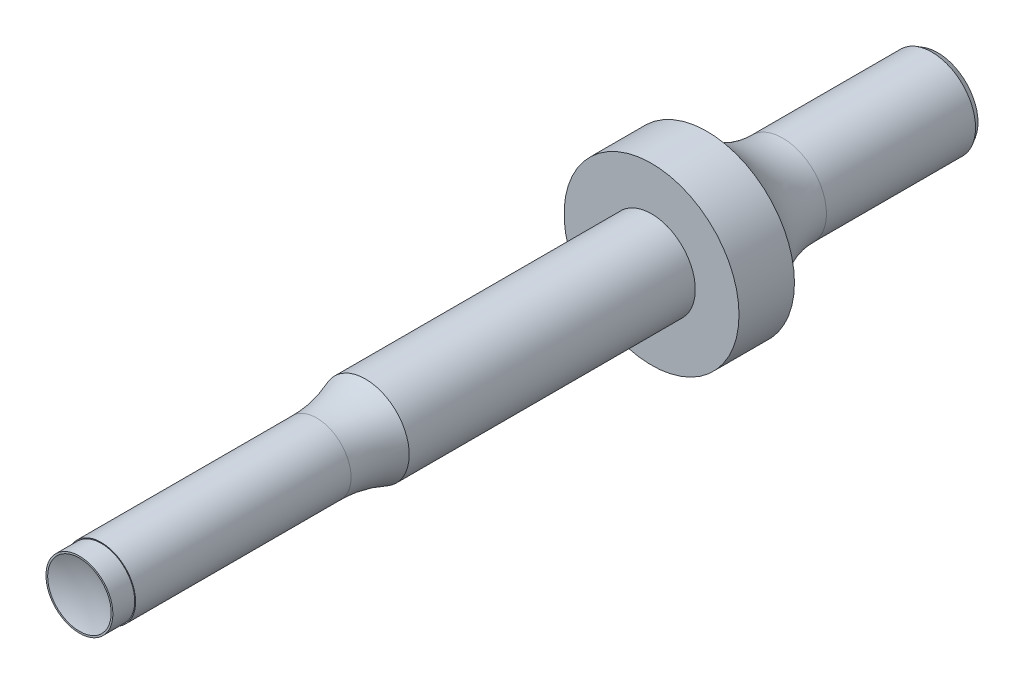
ISO-10303-21;
HEADER;
FILE_DESCRIPTION(('STEP AP214'),'2;1');
FILE_NAME('part.step','',(''),(''),'','','');
FILE_SCHEMA(('AUTOMOTIVE_DESIGN { 1 0 10303 214 1 1 1 1 }'));
ENDSEC;
DATA;
#1=APPLICATION_CONTEXT('core data for automotive mechanical design processes');
#2=APPLICATION_PROTOCOL_DEFINITION('international standard','automotive_design',2000,#1);
#3=PRODUCT_CONTEXT('',#1,'mechanical');
#4=PRODUCT('Part','Part','',(#3));
#5=PRODUCT_RELATED_PRODUCT_CATEGORY('part','',(#4));
#6=PRODUCT_DEFINITION_FORMATION('','',#4);
#7=PRODUCT_DEFINITION_CONTEXT('part definition',#1,'design');
#8=PRODUCT_DEFINITION('design','',#6,#7);
#9=PRODUCT_DEFINITION_SHAPE('','',#8);
#10=(LENGTH_UNIT() NAMED_UNIT(*) SI_UNIT(.MILLI.,.METRE.));
#11=(NAMED_UNIT(*) PLANE_ANGLE_UNIT() SI_UNIT($,.RADIAN.));
#12=(NAMED_UNIT(*) SI_UNIT($,.STERADIAN.) SOLID_ANGLE_UNIT());
#13=UNCERTAINTY_MEASURE_WITH_UNIT(LENGTH_MEASURE(1.E-05),#10,'distance_accuracy_value','');
#14=(GEOMETRIC_REPRESENTATION_CONTEXT(3) GLOBAL_UNCERTAINTY_ASSIGNED_CONTEXT((#13)) GLOBAL_UNIT_ASSIGNED_CONTEXT((#10,
#11,#12)) REPRESENTATION_CONTEXT('',''));
#15=CARTESIAN_POINT('',(0.,0.,0.));
#16=DIRECTION('',(0.,0.,1.));
#17=DIRECTION('',(1.,0.,0.));
#18=AXIS2_PLACEMENT_3D('',#15,#16,#17);
#19=CARTESIAN_POINT('',(0.,0.,-100.));
#20=DIRECTION('',(0.,0.,1.));
#21=DIRECTION('',(1.,0.,0.));
#22=AXIS2_PLACEMENT_3D('',#19,#20,#21);
#23=CYLINDRICAL_SURFACE('',#22,5.095);
#24=CARTESIAN_POINT('',(0.,0.,-33.3333333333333));
#25=DIRECTION('',(0.,0.,-1.));
#26=DIRECTION('',(0.,1.,0.));
#27=AXIS2_PLACEMENT_3D('',#24,#25,#26);
#28=CIRCLE('',#27,5.095);
#29=CARTESIAN_POINT('',(0.,5.095,-33.3333333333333));
#30=VERTEX_POINT('',#29);
#31=EDGE_CURVE('E78',#30,#30,#28,.T.);
#32=ORIENTED_EDGE('',*,*,#31,.T.);
#33=EDGE_LOOP('',(#32));
#34=FACE_BOUND('',#33,.T.);
#35=CARTESIAN_POINT('',(0.,0.,-66.6666666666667));
#36=DIRECTION('',(0.,0.,-1.));
#37=DIRECTION('',(-1.,0.,0.));
#38=AXIS2_PLACEMENT_3D('',#35,#36,#37);
#39=CIRCLE('',#38,5.095);
#40=CARTESIAN_POINT('',(-5.095,0.,-66.6666666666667));
#41=VERTEX_POINT('',#40);
#42=EDGE_CURVE('E44',#41,#41,#39,.F.);
#43=ORIENTED_EDGE('',*,*,#42,.T.);
#44=EDGE_LOOP('',(#43));
#45=FACE_BOUND('',#44,.T.);
#46=ADVANCED_FACE('F40',(#34,#45),#23,.T.);
#47=CARTESIAN_POINT('',(0.,0.,-33.3333333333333));
#48=DIRECTION('',(0.,0.,1.));
#49=DIRECTION('',(1.,0.,0.));
#50=AXIS2_PLACEMENT_3D('',#47,#48,#49);
#51=CYLINDRICAL_SURFACE('',#50,4.);
#52=CARTESIAN_POINT('',(0.,0.,-27.6522132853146));
#53=DIRECTION('',(0.,0.,1.));
#54=DIRECTION('',(0.,-1.,0.));
#55=AXIS2_PLACEMENT_3D('',#52,#53,#54);
#56=CIRCLE('',#55,4.);
#57=CARTESIAN_POINT('',(0.,-4.,-27.6522132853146));
#58=VERTEX_POINT('',#57);
#59=EDGE_CURVE('E12',#58,#58,#56,.F.);
#60=ORIENTED_EDGE('',*,*,#59,.F.);
#61=EDGE_LOOP('',(#60));
#62=FACE_BOUND('',#61,.T.);
#63=CARTESIAN_POINT('',(0.,0.,-2.5475));
#64=DIRECTION('',(0.,0.,1.));
#65=DIRECTION('',(1.,0.,0.));
#66=AXIS2_PLACEMENT_3D('',#63,#64,#65);
#67=CIRCLE('',#66,4.);
#68=CARTESIAN_POINT('',(4.,0.,-2.5475));
#69=VERTEX_POINT('',#68);
#70=EDGE_CURVE('E62',#69,#69,#67,.F.);
#71=ORIENTED_EDGE('',*,*,#70,.T.);
#72=EDGE_LOOP('',(#71));
#73=FACE_BOUND('',#72,.T.);
#74=ADVANCED_FACE('F105',(#62,#73),#51,.T.);
#75=CARTESIAN_POINT('',(0.,0.,-2.5475));
#76=DIRECTION('',(0.,0.,1.));
#77=DIRECTION('',(1.,0.,0.));
#78=AXIS2_PLACEMENT_3D('',#75,#76,#77);
#79=PLANE('',#78);
#80=ORIENTED_EDGE('',*,*,#70,.F.);
#81=EDGE_LOOP('',(#80));
#82=FACE_BOUND('',#81,.T.);
#83=CARTESIAN_POINT('',(0.,0.,-2.5475));
#84=DIRECTION('',(0.,0.,1.));
#85=DIRECTION('',(1.,0.,0.));
#86=AXIS2_PLACEMENT_3D('',#83,#84,#85);
#87=CIRCLE('',#86,3.9);
#88=CARTESIAN_POINT('',(3.9,0.,-2.5475));
#89=VERTEX_POINT('',#88);
#90=EDGE_CURVE('E66',#89,#89,#87,.T.);
#91=ORIENTED_EDGE('',*,*,#90,.F.);
#92=EDGE_LOOP('',(#91));
#93=FACE_BOUND('',#92,.T.);
#94=ADVANCED_FACE('F110',(#82,#93),#79,.T.);
#95=CARTESIAN_POINT('',(0.,0.,-2.5475));
#96=DIRECTION('',(0.,0.,1.));
#97=DIRECTION('',(1.,0.,0.));
#98=AXIS2_PLACEMENT_3D('',#95,#96,#97);
#99=CYLINDRICAL_SURFACE('',#98,3.9);
#100=CARTESIAN_POINT('',(0.,0.,0.));
#101=DIRECTION('',(0.,0.,1.));
#102=DIRECTION('',(1.,0.,0.));
#103=AXIS2_PLACEMENT_3D('',#100,#101,#102);
#104=CIRCLE('',#103,3.9);
#105=CARTESIAN_POINT('',(3.9,0.,0.));
#106=VERTEX_POINT('',#105);
#107=EDGE_CURVE('E67',#106,#106,#104,.T.);
#108=CARTESIAN_POINT('',(3.9,0.,-2.5475));
#109=CARTESIAN_POINT('',(3.9,0.,-2.52096354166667));
#110=CARTESIAN_POINT('',(3.9,0.,-2.49442708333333));
#111=CARTESIAN_POINT('',(3.9,0.,-2.44135416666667));
#112=CARTESIAN_POINT('',(3.9,0.,-2.41481770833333));
#113=CARTESIAN_POINT('',(3.9,0.,-2.36174479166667));
#114=CARTESIAN_POINT('',(3.9,0.,-2.33520833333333));
#115=CARTESIAN_POINT('',(3.9,0.,-2.28213541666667));
#116=CARTESIAN_POINT('',(3.9,0.,-2.25559895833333));
#117=CARTESIAN_POINT('',(3.9,0.,-2.20252604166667));
#118=CARTESIAN_POINT('',(3.9,0.,-2.17598958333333));
#119=CARTESIAN_POINT('',(3.9,0.,-2.12291666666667));
#120=CARTESIAN_POINT('',(3.9,0.,-2.09638020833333));
#121=CARTESIAN_POINT('',(3.9,0.,-2.04330729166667));
#122=CARTESIAN_POINT('',(3.9,0.,-2.01677083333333));
#123=CARTESIAN_POINT('',(3.9,0.,-1.96369791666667));
#124=CARTESIAN_POINT('',(3.9,0.,-1.93716145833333));
#125=CARTESIAN_POINT('',(3.9,0.,-1.88408854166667));
#126=CARTESIAN_POINT('',(3.9,0.,-1.85755208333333));
#127=CARTESIAN_POINT('',(3.9,0.,-1.80447916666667));
#128=CARTESIAN_POINT('',(3.9,0.,-1.77794270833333));
#129=CARTESIAN_POINT('',(3.9,0.,-1.72486979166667));
#130=CARTESIAN_POINT('',(3.9,0.,-1.69833333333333));
#131=CARTESIAN_POINT('',(3.9,0.,-1.64526041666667));
#132=CARTESIAN_POINT('',(3.9,0.,-1.61872395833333));
#133=CARTESIAN_POINT('',(3.9,0.,-1.56565104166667));
#134=CARTESIAN_POINT('',(3.9,0.,-1.53911458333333));
#135=CARTESIAN_POINT('',(3.9,0.,-1.48604166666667));
#136=CARTESIAN_POINT('',(3.9,0.,-1.45950520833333));
#137=CARTESIAN_POINT('',(3.9,0.,-1.40643229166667));
#138=CARTESIAN_POINT('',(3.9,0.,-1.37989583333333));
#139=CARTESIAN_POINT('',(3.9,0.,-1.32682291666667));
#140=CARTESIAN_POINT('',(3.9,0.,-1.30028645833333));
#141=CARTESIAN_POINT('',(3.9,0.,-1.24721354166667));
#142=CARTESIAN_POINT('',(3.9,0.,-1.22067708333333));
#143=CARTESIAN_POINT('',(3.9,0.,-1.16760416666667));
#144=CARTESIAN_POINT('',(3.9,0.,-1.14106770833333));
#145=CARTESIAN_POINT('',(3.9,0.,-1.08799479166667));
#146=CARTESIAN_POINT('',(3.9,0.,-1.06145833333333));
#147=CARTESIAN_POINT('',(3.9,0.,-1.00838541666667));
#148=CARTESIAN_POINT('',(3.9,0.,-0.981848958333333));
#149=CARTESIAN_POINT('',(3.9,0.,-0.928776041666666));
#150=CARTESIAN_POINT('',(3.9,0.,-0.902239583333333));
#151=CARTESIAN_POINT('',(3.9,0.,-0.849166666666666));
#152=CARTESIAN_POINT('',(3.9,0.,-0.822630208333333));
#153=CARTESIAN_POINT('',(3.9,0.,-0.769557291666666));
#154=CARTESIAN_POINT('',(3.9,0.,-0.743020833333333));
#155=CARTESIAN_POINT('',(3.9,0.,-0.689947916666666));
#156=CARTESIAN_POINT('',(3.9,0.,-0.663411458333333));
#157=CARTESIAN_POINT('',(3.9,0.,-0.610338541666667));
#158=CARTESIAN_POINT('',(3.9,0.,-0.583802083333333));
#159=CARTESIAN_POINT('',(3.9,0.,-0.530729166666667));
#160=CARTESIAN_POINT('',(3.9,0.,-0.504192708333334));
#161=CARTESIAN_POINT('',(3.9,0.,-0.451119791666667));
#162=CARTESIAN_POINT('',(3.9,0.,-0.424583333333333));
#163=CARTESIAN_POINT('',(3.9,0.,-0.371510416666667));
#164=CARTESIAN_POINT('',(3.9,0.,-0.344973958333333));
#165=CARTESIAN_POINT('',(3.9,0.,-0.291901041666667));
#166=CARTESIAN_POINT('',(3.9,0.,-0.265364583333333));
#167=CARTESIAN_POINT('',(3.9,0.,-0.212291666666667));
#168=CARTESIAN_POINT('',(3.9,0.,-0.185755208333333));
#169=CARTESIAN_POINT('',(3.9,0.,-0.132682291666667));
#170=CARTESIAN_POINT('',(3.9,0.,-0.106145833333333));
#171=CARTESIAN_POINT('',(3.9,0.,-0.0530729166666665));
#172=CARTESIAN_POINT('',(3.9,0.,-0.0265364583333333));
#173=CARTESIAN_POINT('',(3.9,0.,0.));
#174=B_SPLINE_CURVE_WITH_KNOTS('',3,(#108,#109,#110,#111,#112,#113,#114,#115,#116,#117,#118,
#119,#120,#121,#122,#123,#124,#125,#126,#127,#128,#129,#130,#131,#132,#133,#134,#135,#136,#137,
#138,#139,#140,#141,#142,#143,#144,#145,#146,#147,#148,#149,#150,#151,#152,#153,#154,#155,#156,
#157,#158,#159,#160,#161,#162,#163,#164,#165,#166,#167,#168,#169,#170,#171,#172,#173),
.UNSPECIFIED.,.F.,.F.,(4,2,2,2,2,2,2,2,2,2,2,2,2,2,2,2,2,2,2,2,2,2,2,2,2,2,2,2,2,2,2,2,4),(0.,
0.0796093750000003,0.15921875,0.238828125,0.3184375,0.398046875,0.47765625,0.557265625,0.636875,
0.716484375,0.79609375,0.875703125,0.9553125,1.034921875,1.11453125,1.194140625,1.27375,
1.353359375,1.43296875,1.512578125,1.5921875,1.671796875,1.75140625,1.831015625,1.910625,
1.990234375,2.06984375,2.149453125,2.2290625,2.308671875,2.38828125,2.467890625,2.5475),.UNSPECIFIED.);
#175=EDGE_CURVE('BSEAM147',#89,#106,#174,.T.);
#176=ORIENTED_EDGE('',*,*,#90,.T.);
#177=ORIENTED_EDGE('',*,*,#107,.F.);
#178=ORIENTED_EDGE('',*,*,#175,.T.);
#179=ORIENTED_EDGE('',*,*,#175,.F.);
#180=EDGE_LOOP('',(#176,#178,#177,#179));
#181=FACE_BOUND('',#180,.T.);
#182=ADVANCED_FACE('F147',(#181),#99,.T.);
#183=CARTESIAN_POINT('',(0.,0.,0.));
#184=DIRECTION('',(0.,0.,1.));
#185=DIRECTION('',(1.,0.,0.));
#186=AXIS2_PLACEMENT_3D('',#183,#184,#185);
#187=PLANE('',#186);
#188=CARTESIAN_POINT('',(0.,0.,0.));
#189=DIRECTION('',(0.,0.,1.));
#190=DIRECTION('',(0.,-1.,0.));
#191=AXIS2_PLACEMENT_3D('',#188,#189,#190);
#192=CIRCLE('',#191,3.7);
#193=CARTESIAN_POINT('',(0.,-3.7,0.));
#194=VERTEX_POINT('',#193);
#195=EDGE_CURVE('E71',#194,#194,#192,.T.);
#196=ORIENTED_EDGE('',*,*,#195,.F.);
#197=EDGE_LOOP('',(#196));
#198=FACE_BOUND('',#197,.T.);
#199=ORIENTED_EDGE('',*,*,#107,.T.);
#200=EDGE_LOOP('',(#199));
#201=FACE_BOUND('',#200,.T.);
#202=ADVANCED_FACE('F145',(#198,#201),#187,.T.);
#203=CARTESIAN_POINT('',(0.,0.,9.49453000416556));
#204=DIRECTION('',(0.,0.,1.));
#205=DIRECTION('',(0.,1.,0.));
#206=AXIS2_PLACEMENT_3D('',#203,#204,#205);
#207=SPHERICAL_SURFACE('',#206,10.19);
#208=ORIENTED_EDGE('',*,*,#195,.T.);
#209=EDGE_LOOP('',(#208));
#210=FACE_BOUND('',#209,.T.);
#211=ADVANCED_FACE('F142',(#210),#207,.F.);
#212=CARTESIAN_POINT('',(0.,0.,-27.6522132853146));
#213=DIRECTION('',(0.,0.,-1.));
#214=DIRECTION('',(0.,1.,0.));
#215=AXIS2_PLACEMENT_3D('',#212,#213,#214);
#216=TOROIDAL_SURFACE('',#215,19.285,15.285);
#217=ORIENTED_EDGE('',*,*,#59,.T.);
#218=EDGE_LOOP('',(#217));
#219=FACE_BOUND('',#218,.T.);
#220=ORIENTED_EDGE('',*,*,#31,.F.);
#221=EDGE_LOOP('',(#220));
#222=FACE_BOUND('',#221,.T.);
#223=ADVANCED_FACE('F123',(#219,#222),#216,.F.);
#224=CARTESIAN_POINT('',(0.,0.,-66.6666666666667));
#225=DIRECTION('',(0.,0.,-1.));
#226=DIRECTION('',(-1.,0.,0.));
#227=AXIS2_PLACEMENT_3D('',#224,#225,#226);
#228=PLANE('',#227);
#229=ORIENTED_EDGE('',*,*,#42,.F.);
#230=EDGE_LOOP('',(#229));
#231=FACE_BOUND('',#230,.T.);
#232=CARTESIAN_POINT('',(0.,0.,-66.6666666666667));
#233=DIRECTION('',(0.,0.,1.));
#234=DIRECTION('',(1.,0.,0.));
#235=AXIS2_PLACEMENT_3D('',#232,#233,#234);
#236=CIRCLE('',#235,10.19);
#237=CARTESIAN_POINT('',(10.19,0.,-66.6666666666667));
#238=VERTEX_POINT('',#237);
#239=EDGE_CURVE('E81',#238,#238,#236,.T.);
#240=ORIENTED_EDGE('',*,*,#239,.T.);
#241=EDGE_LOOP('',(#240));
#242=FACE_BOUND('',#241,.T.);
#243=ADVANCED_FACE('F119',(#231,#242),#228,.F.);
#244=CARTESIAN_POINT('',(0.,0.,-66.6666666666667));
#245=DIRECTION('',(0.,0.,1.));
#246=DIRECTION('',(1.,0.,0.));
#247=AXIS2_PLACEMENT_3D('',#244,#245,#246);
#248=CYLINDRICAL_SURFACE('',#247,10.19);
#249=ORIENTED_EDGE('',*,*,#239,.F.);
#250=EDGE_LOOP('',(#249));
#251=FACE_BOUND('',#250,.T.);
#252=CARTESIAN_POINT('',(0.,0.,-73.1268678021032));
#253=DIRECTION('',(0.,0.,1.));
#254=DIRECTION('',(1.,0.,0.));
#255=AXIS2_PLACEMENT_3D('',#252,#253,#254);
#256=CIRCLE('',#255,10.19);
#257=CARTESIAN_POINT('',(10.19,0.,-73.1268678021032));
#258=VERTEX_POINT('',#257);
#259=EDGE_CURVE('E85',#258,#258,#256,.T.);
#260=ORIENTED_EDGE('',*,*,#259,.T.);
#261=EDGE_LOOP('',(#260));
#262=FACE_BOUND('',#261,.T.);
#263=ADVANCED_FACE('F122',(#251,#262),#248,.T.);
#264=CARTESIAN_POINT('',(0.,0.,-81.9516666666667));
#265=DIRECTION('',(0.,0.,1.));
#266=DIRECTION('',(1.,0.,0.));
#267=AXIS2_PLACEMENT_3D('',#264,#265,#266);
#268=TOROIDAL_SURFACE('',#267,15.285,10.19);
#269=ORIENTED_EDGE('',*,*,#259,.F.);
#270=EDGE_LOOP('',(#269));
#271=FACE_BOUND('',#270,.T.);
#272=CARTESIAN_POINT('',(0.,0.,-81.9516666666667));
#273=DIRECTION('',(0.,0.,1.));
#274=DIRECTION('',(1.,0.,0.));
#275=AXIS2_PLACEMENT_3D('',#272,#273,#274);
#276=CIRCLE('',#275,5.095);
#277=CARTESIAN_POINT('',(5.095,0.,-81.9516666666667));
#278=VERTEX_POINT('',#277);
#279=EDGE_CURVE('E89',#278,#278,#276,.T.);
#280=ORIENTED_EDGE('',*,*,#279,.T.);
#281=EDGE_LOOP('',(#280));
#282=FACE_BOUND('',#281,.T.);
#283=ADVANCED_FACE('F93',(#271,#282),#268,.F.);
#284=CARTESIAN_POINT('',(0.,0.,-100.));
#285=DIRECTION('',(0.,0.,1.));
#286=DIRECTION('',(1.,0.,0.));
#287=AXIS2_PLACEMENT_3D('',#284,#285,#286);
#288=PLANE('',#287);
#289=CARTESIAN_POINT('',(0.,0.,-100.));
#290=DIRECTION('',(0.,0.,1.));
#291=DIRECTION('',(1.,0.,0.));
#292=AXIS2_PLACEMENT_3D('',#289,#290,#291);
#293=CIRCLE('',#292,4.70278671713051);
#294=CARTESIAN_POINT('',(4.70278671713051,0.,-100.));
#295=VERTEX_POINT('',#294);
#296=EDGE_CURVE('E49',#295,#295,#293,.F.);
#297=ORIENTED_EDGE('',*,*,#296,.T.);
#298=EDGE_LOOP('',(#297));
#299=FACE_BOUND('',#298,.T.);
#300=ADVANCED_FACE('F101',(#299),#288,.F.);
#301=CARTESIAN_POINT('',(0.,0.,-99.3206666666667));
#302=DIRECTION('',(0.,0.,1.));
#303=DIRECTION('',(1.,0.,0.));
#304=AXIS2_PLACEMENT_3D('',#301,#302,#303);
#305=CONICAL_SURFACE('',#304,5.095,0.523598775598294);
#306=ORIENTED_EDGE('',*,*,#296,.F.);
#307=EDGE_LOOP('',(#306));
#308=FACE_BOUND('',#307,.T.);
#309=CARTESIAN_POINT('',(0.,0.,-99.3206666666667));
#310=DIRECTION('',(0.,0.,1.));
#311=DIRECTION('',(1.,0.,0.));
#312=AXIS2_PLACEMENT_3D('',#309,#310,#311);
#313=CIRCLE('',#312,5.095);
#314=CARTESIAN_POINT('',(5.095,0.,-99.3206666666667));
#315=VERTEX_POINT('',#314);
#316=EDGE_CURVE('E56',#315,#315,#313,.T.);
#317=ORIENTED_EDGE('',*,*,#316,.F.);
#318=EDGE_LOOP('',(#317));
#319=FACE_BOUND('',#318,.T.);
#320=ADVANCED_FACE('F42',(#308,#319),#305,.T.);
#321=ORIENTED_EDGE('',*,*,#316,.T.);
#322=EDGE_LOOP('',(#321));
#323=FACE_BOUND('',#322,.T.);
#324=ORIENTED_EDGE('',*,*,#279,.F.);
#325=EDGE_LOOP('',(#324));
#326=FACE_BOUND('',#325,.T.);
#327=ADVANCED_FACE('F95',(#323,#326),#23,.T.);
#328=CLOSED_SHELL('',(#46,#74,#94,#182,#202,#211,#223,#243,#263,#283,#300,#320,#327));
#329=MANIFOLD_SOLID_BREP('B2',#328);
#330=ADVANCED_BREP_SHAPE_REPRESENTATION('',(#18,#329),#14);
#331=SHAPE_DEFINITION_REPRESENTATION(#9,#330);
ENDSEC;
END-ISO-10303-21;
